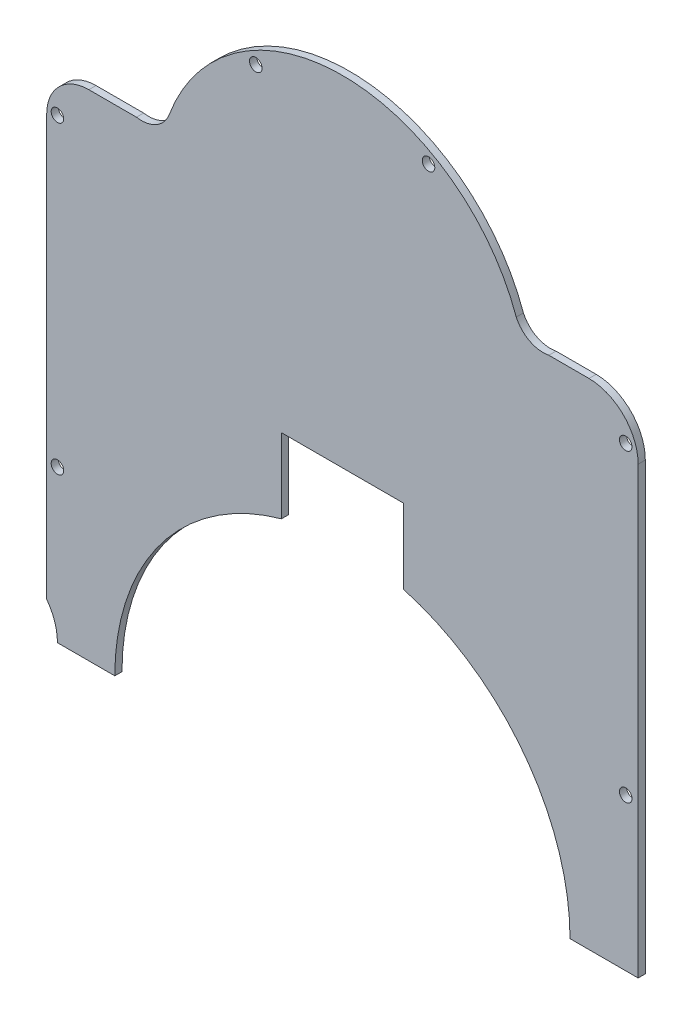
from build123d import *

# Parameters (mm, degrees)
EXTRUSION1_DEPTH              = 2
TROU_TARAUD_M3_51_D           = 3.5
TROU_TARAUD_M3_52_D           = 3.5
TROU_TARAUD_M3_52_ON_FACE_2_D = 3.5


with BuildPart() as part:
    # Esquisse1 → Extrusion1 (new body)
    with BuildSketch(Plane.XY):
        with BuildLine():
            Line((68.787159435, 49.785743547), (57.580914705, 49.785743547))
            ThreePointArc((57.580914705, 49.785743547), (52.22364015, 50.553253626), (48.496171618, 54.476956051))
            ThreePointArc((48.496171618, 54.476956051), (0.282725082, 88.629726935), (-48.302738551, 55.008291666))
            ThreePointArc((-48.302738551, 55.008291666), (-51.932435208, 50.747263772), (-57.446647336, 49.785743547))
            Line((-57.446647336, 49.785743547), (-70.745543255, 49.785743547))
            ThreePointArc((-70.745543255, 49.785743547), (-79.057199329, 46.342942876), (-82.5, 38.031286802))
            Line((-82.5, 38.031286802), (-82.5, -79.214256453))
            ThreePointArc((-82.5, -79.214256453), (-80.269750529, -83.470839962), (-79.5, -88.214256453))
            Line((-79.5, -88.214256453), (-63.5, -88.214256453))
            ThreePointArc((-63.5, -88.214256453), (-50.555662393, -49.790630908), (-17, -27.032151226))
            Line((-17, -27.032151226), (-17, -6.214256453))
            Line((-17, -6.214256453), (17, -6.214256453))
            Line((17, -6.214256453), (17, -27.032151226))
            ThreePointArc((17, -27.032151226), (50.555662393, -49.790630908), (63.5, -88.214256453))
            Line((63.5, -88.214256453), (82.5, -88.214256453))
            Line((82.5, -88.214256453), (82.5, 35.920810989))
            ThreePointArc((82.5, 35.920810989), (78.492730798, 45.671174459), (68.787159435, 49.785743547))
        make_face()
    extrude(amount=EXTRUSION1_DEPTH)

    # Trou taraud_ M3.51 (through all)
    with Locations(Plane(origin=(-24.167385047, 79.125003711, 2), x_dir=(1, 0, 0), z_dir=(0, 0, 1))):
        with Locations((0, 0), (-55.332614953, -39.886345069), (-55.332614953, -124.886345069)):
            Hole(TROU_TARAUD_M3_51_D / 2)

    # Trou taraud_ M3.52 (through all)
    with Locations(Plane(origin=(79.035898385, 39.238658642, 2), x_dir=(1, 0, 0), z_dir=(0, 0, 1))):
        with Locations((0, 0), (0, -85), (-55.016600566, 39.971205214)):
            Hole(TROU_TARAUD_M3_52_D / 2)

    # Trou taraud_ M3.52 on face 2 (through all)
    with Locations(Plane(origin=(112.075167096, 0.07500958, 0), x_dir=(1, 0, 0), z_dir=(0, 0, 1))):
        with Locations((0, 0)):
            Hole(TROU_TARAUD_M3_52_ON_FACE_2_D / 2)


solid = part.part
